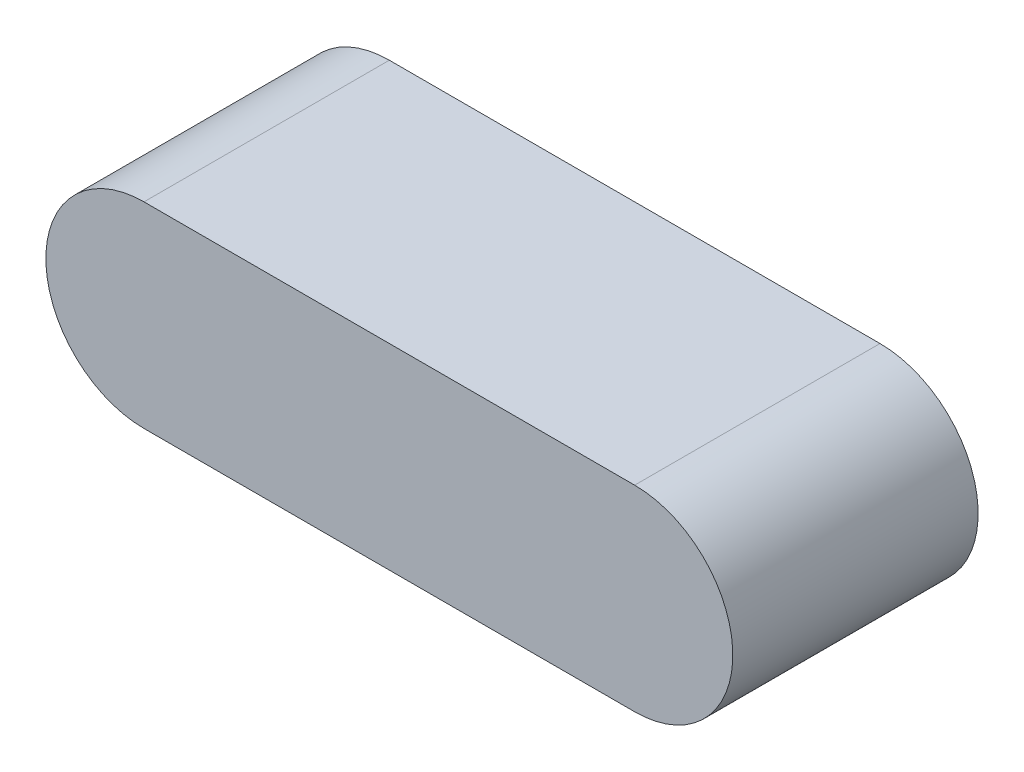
ISO-10303-21;
HEADER;
FILE_DESCRIPTION(('STEP AP214'),'2;1');
FILE_NAME('part.step','',(''),(''),'','','');
FILE_SCHEMA(('AUTOMOTIVE_DESIGN { 1 0 10303 214 1 1 1 1 }'));
ENDSEC;
DATA;
#1=APPLICATION_CONTEXT('core data for automotive mechanical design processes');
#2=APPLICATION_PROTOCOL_DEFINITION('international standard','automotive_design',2000,#1);
#3=PRODUCT_CONTEXT('',#1,'mechanical');
#4=PRODUCT('Part','Part','',(#3));
#5=PRODUCT_RELATED_PRODUCT_CATEGORY('part','',(#4));
#6=PRODUCT_DEFINITION_FORMATION('','',#4);
#7=PRODUCT_DEFINITION_CONTEXT('part definition',#1,'design');
#8=PRODUCT_DEFINITION('design','',#6,#7);
#9=PRODUCT_DEFINITION_SHAPE('','',#8);
#10=(LENGTH_UNIT() NAMED_UNIT(*) SI_UNIT(.MILLI.,.METRE.));
#11=(NAMED_UNIT(*) PLANE_ANGLE_UNIT() SI_UNIT($,.RADIAN.));
#12=(NAMED_UNIT(*) SI_UNIT($,.STERADIAN.) SOLID_ANGLE_UNIT());
#13=UNCERTAINTY_MEASURE_WITH_UNIT(LENGTH_MEASURE(1.E-05),#10,'distance_accuracy_value','');
#14=(GEOMETRIC_REPRESENTATION_CONTEXT(3) GLOBAL_UNCERTAINTY_ASSIGNED_CONTEXT((#13)) GLOBAL_UNIT_ASSIGNED_CONTEXT((#10,
#11,#12)) REPRESENTATION_CONTEXT('',''));
#15=CARTESIAN_POINT('',(0.,0.,0.));
#16=DIRECTION('',(0.,0.,1.));
#17=DIRECTION('',(1.,0.,0.));
#18=AXIS2_PLACEMENT_3D('',#15,#16,#17);
#19=CARTESIAN_POINT('',(2.,0.,1.));
#20=DIRECTION('',(0.,0.,-1.));
#21=DIRECTION('',(-1.,0.,0.));
#22=AXIS2_PLACEMENT_3D('',#19,#20,#21);
#23=CYLINDRICAL_SURFACE('',#22,0.799999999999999);
#24=CARTESIAN_POINT('',(2.,0.,-1.));
#25=DIRECTION('',(0.,0.,1.));
#26=DIRECTION('',(1.,0.,0.));
#27=AXIS2_PLACEMENT_3D('',#24,#25,#26);
#28=CIRCLE('',#27,0.799999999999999);
#29=CARTESIAN_POINT('',(2.,-0.799999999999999,-1.));
#30=VERTEX_POINT('',#29);
#31=CARTESIAN_POINT('',(2.,0.799999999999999,-1.));
#32=VERTEX_POINT('',#31);
#33=EDGE_CURVE('E97',#30,#32,#28,.T.);
#34=ORIENTED_EDGE('',*,*,#33,.T.);
#35=DIRECTION('',(0.,0.,-1.));
#36=VECTOR('',#35,1.);
#37=CARTESIAN_POINT('',(2.,0.799999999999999,1.));
#38=LINE('',#37,#36);
#39=CARTESIAN_POINT('',(2.,0.799999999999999,1.));
#40=VERTEX_POINT('',#39);
#41=EDGE_CURVE('E11',#40,#32,#38,.T.);
#42=ORIENTED_EDGE('',*,*,#41,.F.);
#43=CARTESIAN_POINT('',(2.,0.,1.));
#44=DIRECTION('',(0.,0.,1.));
#45=DIRECTION('',(1.,0.,0.));
#46=AXIS2_PLACEMENT_3D('',#43,#44,#45);
#47=CIRCLE('',#46,0.799999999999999);
#48=CARTESIAN_POINT('',(2.,-0.799999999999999,1.));
#49=VERTEX_POINT('',#48);
#50=EDGE_CURVE('E85',#49,#40,#47,.T.);
#51=ORIENTED_EDGE('',*,*,#50,.F.);
#52=DIRECTION('',(0.,0.,-1.));
#53=VECTOR('',#52,1.);
#54=CARTESIAN_POINT('',(2.,-0.799999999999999,1.));
#55=LINE('',#54,#53);
#56=EDGE_CURVE('E93',#49,#30,#55,.T.);
#57=ORIENTED_EDGE('',*,*,#56,.T.);
#58=EDGE_LOOP('',(#34,#42,#51,#57));
#59=FACE_BOUND('',#58,.T.);
#60=ADVANCED_FACE('F34',(#59),#23,.T.);
#61=CARTESIAN_POINT('',(2.,0.799999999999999,1.));
#62=DIRECTION('',(0.,-1.,0.));
#63=DIRECTION('',(1.,0.,0.));
#64=AXIS2_PLACEMENT_3D('',#61,#62,#63);
#65=PLANE('',#64);
#66=DIRECTION('',(-1.,0.,0.));
#67=VECTOR('',#66,1.);
#68=CARTESIAN_POINT('',(2.,0.799999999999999,-1.));
#69=LINE('',#68,#67);
#70=CARTESIAN_POINT('',(-2.,0.799999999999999,-1.));
#71=VERTEX_POINT('',#70);
#72=EDGE_CURVE('E89',#32,#71,#69,.T.);
#73=ORIENTED_EDGE('',*,*,#72,.T.);
#74=DIRECTION('',(0.,0.,-1.));
#75=VECTOR('',#74,1.);
#76=CARTESIAN_POINT('',(-2.,0.799999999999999,1.));
#77=LINE('',#76,#75);
#78=CARTESIAN_POINT('',(-2.,0.799999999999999,1.));
#79=VERTEX_POINT('',#78);
#80=EDGE_CURVE('E42',#79,#71,#77,.T.);
#81=ORIENTED_EDGE('',*,*,#80,.F.);
#82=DIRECTION('',(-1.,0.,0.));
#83=VECTOR('',#82,1.);
#84=CARTESIAN_POINT('',(2.,0.799999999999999,1.));
#85=LINE('',#84,#83);
#86=EDGE_CURVE('E80',#40,#79,#85,.T.);
#87=ORIENTED_EDGE('',*,*,#86,.F.);
#88=ORIENTED_EDGE('',*,*,#41,.T.);
#89=EDGE_LOOP('',(#73,#81,#87,#88));
#90=FACE_BOUND('',#89,.T.);
#91=ADVANCED_FACE('F88',(#90),#65,.F.);
#92=CARTESIAN_POINT('',(-2.,0.,1.));
#93=DIRECTION('',(0.,0.,-1.));
#94=DIRECTION('',(-1.,0.,0.));
#95=AXIS2_PLACEMENT_3D('',#92,#93,#94);
#96=CYLINDRICAL_SURFACE('',#95,0.799999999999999);
#97=CARTESIAN_POINT('',(-2.,0.,-1.));
#98=DIRECTION('',(0.,0.,1.));
#99=DIRECTION('',(1.,0.,0.));
#100=AXIS2_PLACEMENT_3D('',#97,#98,#99);
#101=CIRCLE('',#100,0.799999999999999);
#102=CARTESIAN_POINT('',(-2.,-0.8,-1.));
#103=VERTEX_POINT('',#102);
#104=EDGE_CURVE('E67',#71,#103,#101,.T.);
#105=ORIENTED_EDGE('',*,*,#104,.T.);
#106=DIRECTION('',(0.,0.,-1.));
#107=VECTOR('',#106,1.);
#108=CARTESIAN_POINT('',(-2.,-0.8,1.));
#109=LINE('',#108,#107);
#110=CARTESIAN_POINT('',(-2.,-0.8,1.));
#111=VERTEX_POINT('',#110);
#112=EDGE_CURVE('E90',#111,#103,#109,.T.);
#113=ORIENTED_EDGE('',*,*,#112,.F.);
#114=CARTESIAN_POINT('',(-2.,0.,1.));
#115=DIRECTION('',(0.,0.,1.));
#116=DIRECTION('',(1.,0.,0.));
#117=AXIS2_PLACEMENT_3D('',#114,#115,#116);
#118=CIRCLE('',#117,0.799999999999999);
#119=EDGE_CURVE('E83',#79,#111,#118,.T.);
#120=ORIENTED_EDGE('',*,*,#119,.F.);
#121=ORIENTED_EDGE('',*,*,#80,.T.);
#122=EDGE_LOOP('',(#105,#113,#120,#121));
#123=FACE_BOUND('',#122,.T.);
#124=ADVANCED_FACE('F91',(#123),#96,.T.);
#125=CARTESIAN_POINT('',(2.,-0.799999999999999,1.));
#126=DIRECTION('',(0.,1.,0.));
#127=DIRECTION('',(-1.,0.,0.));
#128=AXIS2_PLACEMENT_3D('',#125,#126,#127);
#129=PLANE('',#128);
#130=DIRECTION('',(1.,0.,0.));
#131=VECTOR('',#130,1.);
#132=CARTESIAN_POINT('',(2.,-0.799999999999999,-1.));
#133=LINE('',#132,#131);
#134=EDGE_CURVE('E73',#103,#30,#133,.T.);
#135=ORIENTED_EDGE('',*,*,#134,.T.);
#136=ORIENTED_EDGE('',*,*,#56,.F.);
#137=DIRECTION('',(1.,0.,0.));
#138=VECTOR('',#137,1.);
#139=CARTESIAN_POINT('',(2.,-0.799999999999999,1.));
#140=LINE('',#139,#138);
#141=EDGE_CURVE('E50',#111,#49,#140,.T.);
#142=ORIENTED_EDGE('',*,*,#141,.F.);
#143=ORIENTED_EDGE('',*,*,#112,.T.);
#144=EDGE_LOOP('',(#135,#136,#142,#143));
#145=FACE_BOUND('',#144,.T.);
#146=ADVANCED_FACE('F104',(#145),#129,.F.);
#147=CARTESIAN_POINT('',(2.,0.,1.));
#148=DIRECTION('',(0.,0.,1.));
#149=DIRECTION('',(1.,0.,0.));
#150=AXIS2_PLACEMENT_3D('',#147,#148,#149);
#151=PLANE('',#150);
#152=ORIENTED_EDGE('',*,*,#50,.T.);
#153=ORIENTED_EDGE('',*,*,#86,.T.);
#154=ORIENTED_EDGE('',*,*,#119,.T.);
#155=ORIENTED_EDGE('',*,*,#141,.T.);
#156=EDGE_LOOP('',(#152,#153,#154,#155));
#157=FACE_BOUND('',#156,.T.);
#158=ADVANCED_FACE('F81',(#157),#151,.T.);
#159=CARTESIAN_POINT('',(2.,0.,-1.));
#160=DIRECTION('',(0.,0.,1.));
#161=DIRECTION('',(1.,0.,0.));
#162=AXIS2_PLACEMENT_3D('',#159,#160,#161);
#163=PLANE('',#162);
#164=ORIENTED_EDGE('',*,*,#33,.F.);
#165=ORIENTED_EDGE('',*,*,#134,.F.);
#166=ORIENTED_EDGE('',*,*,#104,.F.);
#167=ORIENTED_EDGE('',*,*,#72,.F.);
#168=EDGE_LOOP('',(#164,#165,#166,#167));
#169=FACE_BOUND('',#168,.T.);
#170=ADVANCED_FACE('F107',(#169),#163,.F.);
#171=CLOSED_SHELL('',(#60,#91,#124,#146,#158,#170));
#172=MANIFOLD_SOLID_BREP('B2',#171);
#173=ADVANCED_BREP_SHAPE_REPRESENTATION('',(#18,#172),#14);
#174=SHAPE_DEFINITION_REPRESENTATION(#9,#173);
ENDSEC;
END-ISO-10303-21;
